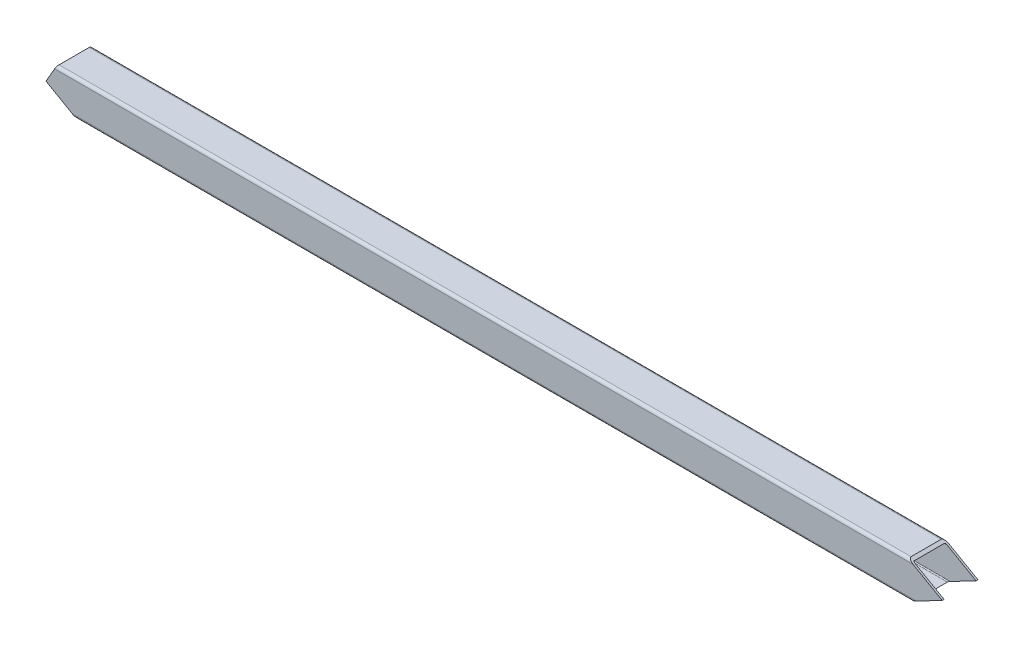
ISO-10303-21;
HEADER;
FILE_DESCRIPTION(('STEP AP214'),'2;1');
FILE_NAME('part.step','',(''),(''),'','','');
FILE_SCHEMA(('AUTOMOTIVE_DESIGN { 1 0 10303 214 1 1 1 1 }'));
ENDSEC;
DATA;
#1=APPLICATION_CONTEXT('core data for automotive mechanical design processes');
#2=APPLICATION_PROTOCOL_DEFINITION('international standard','automotive_design',2000,#1);
#3=PRODUCT_CONTEXT('',#1,'mechanical');
#4=PRODUCT('Part','Part','',(#3));
#5=PRODUCT_RELATED_PRODUCT_CATEGORY('part','',(#4));
#6=PRODUCT_DEFINITION_FORMATION('','',#4);
#7=PRODUCT_DEFINITION_CONTEXT('part definition',#1,'design');
#8=PRODUCT_DEFINITION('design','',#6,#7);
#9=PRODUCT_DEFINITION_SHAPE('','',#8);
#10=(LENGTH_UNIT() NAMED_UNIT(*) SI_UNIT(.MILLI.,.METRE.));
#11=(NAMED_UNIT(*) PLANE_ANGLE_UNIT() SI_UNIT($,.RADIAN.));
#12=(NAMED_UNIT(*) SI_UNIT($,.STERADIAN.) SOLID_ANGLE_UNIT());
#13=UNCERTAINTY_MEASURE_WITH_UNIT(LENGTH_MEASURE(1.E-05),#10,'distance_accuracy_value','');
#14=(GEOMETRIC_REPRESENTATION_CONTEXT(3) GLOBAL_UNCERTAINTY_ASSIGNED_CONTEXT((#13)) GLOBAL_UNIT_ASSIGNED_CONTEXT((#10,
#11,#12)) REPRESENTATION_CONTEXT('',''));
#15=CARTESIAN_POINT('',(0.,0.,0.));
#16=DIRECTION('',(0.,0.,1.));
#17=DIRECTION('',(1.,0.,0.));
#18=AXIS2_PLACEMENT_3D('',#15,#16,#17);
#19=CARTESIAN_POINT('',(1016.,2.54,29.21));
#20=DIRECTION('',(-1.,0.,0.));
#21=DIRECTION('',(0.,0.,1.));
#22=AXIS2_PLACEMENT_3D('',#19,#20,#21);
#23=CYLINDRICAL_SURFACE('',#22,2.54);
#24=DIRECTION('',(-1.,0.,0.));
#25=VECTOR('',#24,1.);
#26=CARTESIAN_POINT('',(1016.,2.54000000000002,31.75));
#27=LINE('',#26,#25);
#28=CARTESIAN_POINT('',(772.2933560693,2.54000000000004,31.75));
#29=VERTEX_POINT('',#28);
#30=CARTESIAN_POINT('',(23.305843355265,2.53999999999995,31.75));
#31=VERTEX_POINT('',#30);
#32=EDGE_CURVE('E307',#29,#31,#27,.T.);
#33=ORIENTED_EDGE('',*,*,#32,.T.);
#34=CARTESIAN_POINT('',(23.3058433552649,2.54,29.21));
#35=DIRECTION('',(0.496626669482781,0.867964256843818,0.));
#36=DIRECTION('',(-0.867964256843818,0.496626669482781,0.));
#37=AXIS2_PLACEMENT_3D('',#34,#35,#36);
#38=ELLIPSE('',#37,5.11450583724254,2.54);
#39=CARTESIAN_POINT('',(27.7450516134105,0.,29.21));
#40=VERTEX_POINT('',#39);
#41=EDGE_CURVE('E179',#31,#40,#38,.T.);
#42=ORIENTED_EDGE('',*,*,#41,.T.);
#43=DIRECTION('',(-1.,0.,0.));
#44=VECTOR('',#43,1.);
#45=CARTESIAN_POINT('',(1016.,0.,29.21));
#46=LINE('',#45,#44);
#47=CARTESIAN_POINT('',(767.420488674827,0.,29.21));
#48=VERTEX_POINT('',#47);
#49=EDGE_CURVE('E325',#48,#40,#46,.T.);
#50=ORIENTED_EDGE('',*,*,#49,.F.);
#51=CARTESIAN_POINT('',(772.2933560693,2.54,29.21));
#52=DIRECTION('',(0.462227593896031,-0.886761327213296,0.));
#53=DIRECTION('',(-0.886761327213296,-0.462227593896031,0.));
#54=AXIS2_PLACEMENT_3D('',#51,#52,#53);
#55=ELLIPSE('',#54,5.49512844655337,2.54);
#56=EDGE_CURVE('E261',#29,#48,#55,.T.);
#57=ORIENTED_EDGE('',*,*,#56,.F.);
#58=EDGE_LOOP('',(#33,#42,#50,#57));
#59=FACE_BOUND('',#58,.T.);
#60=ADVANCED_FACE('F39',(#59),#23,.T.);
#61=CARTESIAN_POINT('',(1016.,0.,29.21));
#62=DIRECTION('',(0.,1.,0.));
#63=DIRECTION('',(0.,0.,1.));
#64=AXIS2_PLACEMENT_3D('',#61,#62,#63);
#65=PLANE('',#64);
#66=ORIENTED_EDGE('',*,*,#49,.T.);
#67=DIRECTION('',(0.,0.,-1.));
#68=VECTOR('',#67,1.);
#69=CARTESIAN_POINT('',(27.7450516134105,0.,29.21));
#70=LINE('',#69,#68);
#71=CARTESIAN_POINT('',(27.7450516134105,0.,2.54000000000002));
#72=VERTEX_POINT('',#71);
#73=EDGE_CURVE('E230',#40,#72,#70,.T.);
#74=ORIENTED_EDGE('',*,*,#73,.T.);
#75=DIRECTION('',(-1.,0.,0.));
#76=VECTOR('',#75,1.);
#77=CARTESIAN_POINT('',(1016.,0.,2.54000000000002));
#78=LINE('',#77,#76);
#79=CARTESIAN_POINT('',(767.420488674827,0.,2.54000000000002));
#80=VERTEX_POINT('',#79);
#81=EDGE_CURVE('E322',#80,#72,#78,.T.);
#82=ORIENTED_EDGE('',*,*,#81,.F.);
#83=DIRECTION('',(0.,0.,-1.));
#84=VECTOR('',#83,1.);
#85=CARTESIAN_POINT('',(767.420488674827,0.,29.21));
#86=LINE('',#85,#84);
#87=EDGE_CURVE('E259',#48,#80,#86,.T.);
#88=ORIENTED_EDGE('',*,*,#87,.F.);
#89=EDGE_LOOP('',(#66,#74,#82,#88));
#90=FACE_BOUND('',#89,.T.);
#91=ADVANCED_FACE('F381',(#90),#65,.F.);
#92=CARTESIAN_POINT('',(1016.,2.54,2.54));
#93=DIRECTION('',(-1.,0.,0.));
#94=DIRECTION('',(0.,0.,1.));
#95=AXIS2_PLACEMENT_3D('',#92,#93,#94);
#96=CYLINDRICAL_SURFACE('',#95,2.54);
#97=ORIENTED_EDGE('',*,*,#81,.T.);
#98=CARTESIAN_POINT('',(23.3058433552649,2.54,2.54));
#99=DIRECTION('',(0.496626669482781,0.867964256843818,0.));
#100=DIRECTION('',(-0.867964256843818,0.496626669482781,0.));
#101=AXIS2_PLACEMENT_3D('',#98,#99,#100);
#102=ELLIPSE('',#101,5.11450583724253,2.54);
#103=CARTESIAN_POINT('',(23.305843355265,2.53999999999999,0.));
#104=VERTEX_POINT('',#103);
#105=EDGE_CURVE('E227',#72,#104,#102,.T.);
#106=ORIENTED_EDGE('',*,*,#105,.T.);
#107=DIRECTION('',(-1.,0.,0.));
#108=VECTOR('',#107,1.);
#109=CARTESIAN_POINT('',(1016.,2.54000000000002,0.));
#110=LINE('',#109,#108);
#111=CARTESIAN_POINT('',(772.2933560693,2.54,0.));
#112=VERTEX_POINT('',#111);
#113=EDGE_CURVE('E319',#112,#104,#110,.T.);
#114=ORIENTED_EDGE('',*,*,#113,.F.);
#115=CARTESIAN_POINT('',(772.2933560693,2.54,2.54));
#116=DIRECTION('',(0.462227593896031,-0.886761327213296,0.));
#117=DIRECTION('',(-0.886761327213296,-0.462227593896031,0.));
#118=AXIS2_PLACEMENT_3D('',#115,#116,#117);
#119=ELLIPSE('',#118,5.49512844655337,2.54);
#120=EDGE_CURVE('E257',#80,#112,#119,.T.);
#121=ORIENTED_EDGE('',*,*,#120,.F.);
#122=EDGE_LOOP('',(#97,#106,#114,#121));
#123=FACE_BOUND('',#122,.T.);
#124=ADVANCED_FACE('F387',(#123),#96,.T.);
#125=CARTESIAN_POINT('',(1016.,2.54000000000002,0.));
#126=DIRECTION('',(0.,0.,1.));
#127=DIRECTION('',(1.,0.,0.));
#128=AXIS2_PLACEMENT_3D('',#125,#126,#127);
#129=PLANE('',#128);
#130=DIRECTION('',(-0.867964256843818,0.496626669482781,0.));
#131=VECTOR('',#130,1.);
#132=CARTESIAN_POINT('',(771.163850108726,-425.364983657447,0.));
#133=LINE('',#132,#131);
#134=CARTESIAN_POINT('',(0.,15.8750000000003,0.));
#135=VERTEX_POINT('',#134);
#136=EDGE_CURVE('E224',#104,#135,#133,.T.);
#137=ORIENTED_EDGE('',*,*,#136,.T.);
#138=DIRECTION('',(0.497053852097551,0.86771969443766,0.));
#139=VECTOR('',#138,1.);
#140=CARTESIAN_POINT('',(245.264101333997,444.038850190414,0.));
#141=LINE('',#140,#139);
#142=CARTESIAN_POINT('',(7.63865699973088,29.21,0.));
#143=VERTEX_POINT('',#142);
#144=EDGE_CURVE('E211',#135,#143,#141,.T.);
#145=ORIENTED_EDGE('',*,*,#144,.T.);
#146=DIRECTION('',(-1.,0.,0.));
#147=VECTOR('',#146,1.);
#148=CARTESIAN_POINT('',(1016.,29.21,0.));
#149=LINE('',#148,#147);
#150=CARTESIAN_POINT('',(769.442558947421,29.21,0.));
#151=VERTEX_POINT('',#150);
#152=EDGE_CURVE('E316',#151,#143,#149,.T.);
#153=ORIENTED_EDGE('',*,*,#152,.F.);
#154=DIRECTION('',(0.867964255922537,-0.496626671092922,0.));
#155=VECTOR('',#154,1.);
#156=CARTESIAN_POINT('',(966.685768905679,-83.6474570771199,0.));
#157=LINE('',#156,#155);
#158=CARTESIAN_POINT('',(795.192763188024,14.476399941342,0.));
#159=VERTEX_POINT('',#158);
#160=EDGE_CURVE('E280',#151,#159,#157,.T.);
#161=ORIENTED_EDGE('',*,*,#160,.T.);
#162=DIRECTION('',(0.886761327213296,0.462227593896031,0.));
#163=VECTOR('',#162,1.);
#164=CARTESIAN_POINT('',(963.931015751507,102.431832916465,0.));
#165=LINE('',#164,#163);
#166=EDGE_CURVE('E255',#112,#159,#165,.T.);
#167=ORIENTED_EDGE('',*,*,#166,.F.);
#168=ORIENTED_EDGE('',*,*,#113,.T.);
#169=EDGE_LOOP('',(#137,#145,#153,#161,#167,#168));
#170=FACE_BOUND('',#169,.T.);
#171=ADVANCED_FACE('F364',(#170),#129,.F.);
#172=CARTESIAN_POINT('',(1016.,29.21,31.75));
#173=DIRECTION('',(0.,0.,-1.));
#174=DIRECTION('',(0.,1.,0.));
#175=AXIS2_PLACEMENT_3D('',#172,#173,#174);
#176=PLANE('',#175);
#177=DIRECTION('',(-1.,0.,0.));
#178=VECTOR('',#177,1.);
#179=CARTESIAN_POINT('',(1016.,29.21,31.75));
#180=LINE('',#179,#178);
#181=CARTESIAN_POINT('',(769.442558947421,29.21,31.75));
#182=VERTEX_POINT('',#181);
#183=CARTESIAN_POINT('',(7.63865699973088,29.21,31.75));
#184=VERTEX_POINT('',#183);
#185=EDGE_CURVE('E194',#182,#184,#180,.T.);
#186=ORIENTED_EDGE('',*,*,#185,.T.);
#187=DIRECTION('',(0.49705385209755,0.86771969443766,0.));
#188=VECTOR('',#187,1.);
#189=CARTESIAN_POINT('',(0.,15.8750000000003,31.75));
#190=LINE('',#189,#188);
#191=CARTESIAN_POINT('',(0.,15.8750000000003,31.75));
#192=VERTEX_POINT('',#191);
#193=EDGE_CURVE('E53',#192,#184,#190,.T.);
#194=ORIENTED_EDGE('',*,*,#193,.F.);
#195=DIRECTION('',(-0.867964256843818,0.496626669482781,0.));
#196=VECTOR('',#195,1.);
#197=CARTESIAN_POINT('',(0.,15.8750000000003,31.75));
#198=LINE('',#197,#196);
#199=EDGE_CURVE('E174',#31,#192,#198,.T.);
#200=ORIENTED_EDGE('',*,*,#199,.F.);
#201=ORIENTED_EDGE('',*,*,#32,.F.);
#202=DIRECTION('',(0.886761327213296,0.462227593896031,0.));
#203=VECTOR('',#202,1.);
#204=CARTESIAN_POINT('',(729.94766813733,-19.5328451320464,31.75));
#205=LINE('',#204,#203);
#206=CARTESIAN_POINT('',(795.192763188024,14.476399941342,31.75));
#207=VERTEX_POINT('',#206);
#208=EDGE_CURVE('E234',#29,#207,#205,.T.);
#209=ORIENTED_EDGE('',*,*,#208,.T.);
#210=DIRECTION('',(0.867964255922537,-0.496626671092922,0.));
#211=VECTOR('',#210,1.);
#212=CARTESIAN_POINT('',(745.815003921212,42.7290751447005,31.75));
#213=LINE('',#212,#211);
#214=EDGE_CURVE('E237',#182,#207,#213,.T.);
#215=ORIENTED_EDGE('',*,*,#214,.F.);
#216=EDGE_LOOP('',(#186,#194,#200,#201,#209,#215));
#217=FACE_BOUND('',#216,.T.);
#218=ADVANCED_FACE('F191',(#217),#176,.F.);
#219=CARTESIAN_POINT('',(1016.,2.54,2.54));
#220=DIRECTION('',(-1.,0.,0.));
#221=DIRECTION('',(0.,0.,1.));
#222=AXIS2_PLACEMENT_3D('',#219,#220,#221);
#223=CYLINDRICAL_SURFACE('',#222,0.889);
#224=CARTESIAN_POINT('',(23.3058433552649,2.54,2.54));
#225=DIRECTION('',(0.496626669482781,0.867964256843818,0.));
#226=DIRECTION('',(-0.867964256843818,0.496626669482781,0.));
#227=AXIS2_PLACEMENT_3D('',#224,#225,#226);
#228=ELLIPSE('',#227,1.79007704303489,0.889);
#229=CARTESIAN_POINT('',(24.8595662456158,1.651,2.54000000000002));
#230=VERTEX_POINT('',#229);
#231=CARTESIAN_POINT('',(23.3058433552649,2.54000000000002,1.651));
#232=VERTEX_POINT('',#231);
#233=EDGE_CURVE('E220',#230,#232,#228,.T.);
#234=ORIENTED_EDGE('',*,*,#233,.F.);
#235=DIRECTION('',(-1.,0.,0.));
#236=VECTOR('',#235,1.);
#237=CARTESIAN_POINT('',(1016.,1.651,2.54000000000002));
#238=LINE('',#237,#236);
#239=CARTESIAN_POINT('',(770.587852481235,1.651,2.54000000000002));
#240=VERTEX_POINT('',#239);
#241=EDGE_CURVE('E283',#240,#230,#238,.T.);
#242=ORIENTED_EDGE('',*,*,#241,.F.);
#243=CARTESIAN_POINT('',(772.2933560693,2.54,2.54));
#244=DIRECTION('',(0.462227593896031,-0.886761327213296,0.));
#245=DIRECTION('',(-0.886761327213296,-0.462227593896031,0.));
#246=AXIS2_PLACEMENT_3D('',#243,#244,#245);
#247=ELLIPSE('',#246,1.92329495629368,0.889);
#248=CARTESIAN_POINT('',(772.2933560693,2.54000000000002,1.651));
#249=VERTEX_POINT('',#248);
#250=EDGE_CURVE('E249',#240,#249,#247,.T.);
#251=ORIENTED_EDGE('',*,*,#250,.T.);
#252=DIRECTION('',(-1.,0.,0.));
#253=VECTOR('',#252,1.);
#254=CARTESIAN_POINT('',(1016.,2.54000000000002,1.651));
#255=LINE('',#254,#253);
#256=EDGE_CURVE('E304',#249,#232,#255,.T.);
#257=ORIENTED_EDGE('',*,*,#256,.T.);
#258=EDGE_LOOP('',(#234,#242,#251,#257));
#259=FACE_BOUND('',#258,.T.);
#260=ADVANCED_FACE('F354',(#259),#223,.F.);
#261=CARTESIAN_POINT('',(1016.,2.54000000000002,1.651));
#262=DIRECTION('',(0.,0.,1.));
#263=DIRECTION('',(1.,0.,0.));
#264=AXIS2_PLACEMENT_3D('',#261,#262,#263);
#265=PLANE('',#264);
#266=DIRECTION('',(0.497053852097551,0.86771969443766,0.));
#267=VECTOR('',#266,1.);
#268=CARTESIAN_POINT('',(245.264101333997,444.038850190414,1.651));
#269=LINE('',#268,#267);
#270=CARTESIAN_POINT('',(0.,15.8750000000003,1.651));
#271=VERTEX_POINT('',#270);
#272=CARTESIAN_POINT('',(7.63865699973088,29.21,1.651));
#273=VERTEX_POINT('',#272);
#274=EDGE_CURVE('E204',#271,#273,#269,.T.);
#275=ORIENTED_EDGE('',*,*,#274,.F.);
#276=DIRECTION('',(-0.867964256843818,0.496626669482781,0.));
#277=VECTOR('',#276,1.);
#278=CARTESIAN_POINT('',(771.163850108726,-425.364983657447,1.651));
#279=LINE('',#278,#277);
#280=EDGE_CURVE('E222',#232,#271,#279,.T.);
#281=ORIENTED_EDGE('',*,*,#280,.F.);
#282=ORIENTED_EDGE('',*,*,#256,.F.);
#283=DIRECTION('',(0.886761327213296,0.462227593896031,0.));
#284=VECTOR('',#283,1.);
#285=CARTESIAN_POINT('',(963.931015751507,102.431832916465,1.651));
#286=LINE('',#285,#284);
#287=CARTESIAN_POINT('',(795.192763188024,14.476399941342,1.651));
#288=VERTEX_POINT('',#287);
#289=EDGE_CURVE('E252',#249,#288,#286,.T.);
#290=ORIENTED_EDGE('',*,*,#289,.T.);
#291=DIRECTION('',(0.867964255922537,-0.496626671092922,0.));
#292=VECTOR('',#291,1.);
#293=CARTESIAN_POINT('',(966.685768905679,-83.6474570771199,1.651));
#294=LINE('',#293,#292);
#295=CARTESIAN_POINT('',(769.442558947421,29.21,1.651));
#296=VERTEX_POINT('',#295);
#297=EDGE_CURVE('E269',#296,#288,#294,.T.);
#298=ORIENTED_EDGE('',*,*,#297,.F.);
#299=DIRECTION('',(-1.,0.,0.));
#300=VECTOR('',#299,1.);
#301=CARTESIAN_POINT('',(1016.,29.21,1.651));
#302=LINE('',#301,#300);
#303=EDGE_CURVE('E301',#296,#273,#302,.T.);
#304=ORIENTED_EDGE('',*,*,#303,.T.);
#305=EDGE_LOOP('',(#275,#281,#282,#290,#298,#304));
#306=FACE_BOUND('',#305,.T.);
#307=ADVANCED_FACE('F358',(#306),#265,.T.);
#308=CARTESIAN_POINT('',(1016.,29.21,30.099));
#309=DIRECTION('',(0.,0.,-1.));
#310=DIRECTION('',(-1.,0.,0.));
#311=AXIS2_PLACEMENT_3D('',#308,#309,#310);
#312=PLANE('',#311);
#313=DIRECTION('',(-0.497053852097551,-0.86771969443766,0.));
#314=VECTOR('',#313,1.);
#315=CARTESIAN_POINT('',(256.76696345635,464.11969246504,30.099));
#316=LINE('',#315,#314);
#317=CARTESIAN_POINT('',(7.63865699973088,29.21,30.099));
#318=VERTEX_POINT('',#317);
#319=CARTESIAN_POINT('',(0.,15.8750000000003,30.099));
#320=VERTEX_POINT('',#319);
#321=EDGE_CURVE('E187',#318,#320,#316,.T.);
#322=ORIENTED_EDGE('',*,*,#321,.F.);
#323=DIRECTION('',(-1.,0.,0.));
#324=VECTOR('',#323,1.);
#325=CARTESIAN_POINT('',(1016.,29.21,30.099));
#326=LINE('',#325,#324);
#327=CARTESIAN_POINT('',(769.442558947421,29.21,30.099));
#328=VERTEX_POINT('',#327);
#329=EDGE_CURVE('E292',#328,#318,#326,.T.);
#330=ORIENTED_EDGE('',*,*,#329,.F.);
#331=DIRECTION('',(-0.867964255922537,0.496626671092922,0.));
#332=VECTOR('',#331,1.);
#333=CARTESIAN_POINT('',(955.18955341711,-77.0696202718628,30.099));
#334=LINE('',#333,#332);
#335=CARTESIAN_POINT('',(795.192763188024,14.476399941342,30.099));
#336=VERTEX_POINT('',#335);
#337=EDGE_CURVE('E46',#336,#328,#334,.T.);
#338=ORIENTED_EDGE('',*,*,#337,.F.);
#339=DIRECTION('',(-0.886761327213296,-0.462227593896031,0.));
#340=VECTOR('',#339,1.);
#341=CARTESIAN_POINT('',(974.862663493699,108.129994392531,30.099));
#342=LINE('',#341,#340);
#343=CARTESIAN_POINT('',(772.2933560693,2.54000000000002,30.099));
#344=VERTEX_POINT('',#343);
#345=EDGE_CURVE('E246',#336,#344,#342,.T.);
#346=ORIENTED_EDGE('',*,*,#345,.T.);
#347=DIRECTION('',(-1.,0.,0.));
#348=VECTOR('',#347,1.);
#349=CARTESIAN_POINT('',(1016.,2.54000000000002,30.099));
#350=LINE('',#349,#348);
#351=CARTESIAN_POINT('',(23.3058433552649,2.54000000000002,30.099));
#352=VERTEX_POINT('',#351);
#353=EDGE_CURVE('E289',#344,#352,#350,.T.);
#354=ORIENTED_EDGE('',*,*,#353,.T.);
#355=DIRECTION('',(0.867964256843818,-0.496626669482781,0.));
#356=VECTOR('',#355,1.);
#357=CARTESIAN_POINT('',(759.667634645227,-418.787146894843,30.099));
#358=LINE('',#357,#356);
#359=EDGE_CURVE('E218',#320,#352,#358,.T.);
#360=ORIENTED_EDGE('',*,*,#359,.F.);
#361=EDGE_LOOP('',(#322,#330,#338,#346,#354,#360));
#362=FACE_BOUND('',#361,.T.);
#363=ADVANCED_FACE('F341',(#362),#312,.T.);
#364=CARTESIAN_POINT('',(1016.,2.54,29.21));
#365=DIRECTION('',(-1.,0.,0.));
#366=DIRECTION('',(0.,0.,1.));
#367=AXIS2_PLACEMENT_3D('',#364,#365,#366);
#368=CYLINDRICAL_SURFACE('',#367,0.889000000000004);
#369=CARTESIAN_POINT('',(23.3058433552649,2.54,29.21));
#370=DIRECTION('',(0.496626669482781,0.867964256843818,0.));
#371=DIRECTION('',(-0.867964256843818,0.496626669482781,0.));
#372=AXIS2_PLACEMENT_3D('',#369,#370,#371);
#373=ELLIPSE('',#372,1.7900770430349,0.889000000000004);
#374=CARTESIAN_POINT('',(24.8595662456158,1.651,29.21));
#375=VERTEX_POINT('',#374);
#376=EDGE_CURVE('E216',#352,#375,#373,.T.);
#377=ORIENTED_EDGE('',*,*,#376,.F.);
#378=ORIENTED_EDGE('',*,*,#353,.F.);
#379=CARTESIAN_POINT('',(772.2933560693,2.54,29.21));
#380=DIRECTION('',(0.462227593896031,-0.886761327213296,0.));
#381=DIRECTION('',(-0.886761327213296,-0.462227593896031,0.));
#382=AXIS2_PLACEMENT_3D('',#379,#380,#381);
#383=ELLIPSE('',#382,1.92329495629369,0.889000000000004);
#384=CARTESIAN_POINT('',(770.587852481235,1.651,29.21));
#385=VERTEX_POINT('',#384);
#386=EDGE_CURVE('E243',#344,#385,#383,.T.);
#387=ORIENTED_EDGE('',*,*,#386,.T.);
#388=DIRECTION('',(-1.,0.,0.));
#389=VECTOR('',#388,1.);
#390=CARTESIAN_POINT('',(1016.,1.651,29.21));
#391=LINE('',#390,#389);
#392=EDGE_CURVE('E286',#385,#375,#391,.T.);
#393=ORIENTED_EDGE('',*,*,#392,.T.);
#394=EDGE_LOOP('',(#377,#378,#387,#393));
#395=FACE_BOUND('',#394,.T.);
#396=ADVANCED_FACE('F346',(#395),#368,.F.);
#397=CARTESIAN_POINT('',(1016.,1.651,29.21));
#398=DIRECTION('',(0.,1.,0.));
#399=DIRECTION('',(0.,0.,1.));
#400=AXIS2_PLACEMENT_3D('',#397,#398,#399);
#401=PLANE('',#400);
#402=DIRECTION('',(0.,0.,-1.));
#403=VECTOR('',#402,1.);
#404=CARTESIAN_POINT('',(24.8595662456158,1.651,29.21));
#405=LINE('',#404,#403);
#406=EDGE_CURVE('E214',#375,#230,#405,.T.);
#407=ORIENTED_EDGE('',*,*,#406,.F.);
#408=ORIENTED_EDGE('',*,*,#392,.F.);
#409=DIRECTION('',(0.,0.,-1.));
#410=VECTOR('',#409,1.);
#411=CARTESIAN_POINT('',(770.587852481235,1.651,29.21));
#412=LINE('',#411,#410);
#413=EDGE_CURVE('E328',#385,#240,#412,.T.);
#414=ORIENTED_EDGE('',*,*,#413,.T.);
#415=ORIENTED_EDGE('',*,*,#241,.T.);
#416=EDGE_LOOP('',(#407,#408,#414,#415));
#417=FACE_BOUND('',#416,.T.);
#418=ADVANCED_FACE('F349',(#417),#401,.T.);
#419=CARTESIAN_POINT('',(1016.,29.21,2.54));
#420=DIRECTION('',(-1.,0.,0.));
#421=DIRECTION('',(0.,0.,1.));
#422=AXIS2_PLACEMENT_3D('',#419,#420,#421);
#423=CYLINDRICAL_SURFACE('',#422,2.54);
#424=ORIENTED_EDGE('',*,*,#152,.T.);
#425=CARTESIAN_POINT('',(7.63865699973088,29.21,2.54));
#426=DIRECTION('',(0.86771969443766,-0.497053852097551,0.));
#427=DIRECTION('',(-0.497053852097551,-0.86771969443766,0.));
#428=AXIS2_PLACEMENT_3D('',#425,#426,#427);
#429=ELLIPSE('',#428,2.92721257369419,2.54);
#430=CARTESIAN_POINT('',(9.09363928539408,31.75,2.54000000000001));
#431=VERTEX_POINT('',#430);
#432=EDGE_CURVE('E208',#143,#431,#429,.T.);
#433=ORIENTED_EDGE('',*,*,#432,.T.);
#434=DIRECTION('',(-1.,0.,0.));
#435=VECTOR('',#434,1.);
#436=CARTESIAN_POINT('',(1016.,31.75,2.54000000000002));
#437=LINE('',#436,#435);
#438=CARTESIAN_POINT('',(765.00335070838,31.75,2.54000000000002));
#439=VERTEX_POINT('',#438);
#440=EDGE_CURVE('E313',#439,#431,#437,.T.);
#441=ORIENTED_EDGE('',*,*,#440,.F.);
#442=CARTESIAN_POINT('',(769.442558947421,29.21,2.54));
#443=DIRECTION('',(-0.496626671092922,-0.867964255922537,0.));
#444=DIRECTION('',(-0.867964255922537,0.496626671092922,0.));
#445=AXIS2_PLACEMENT_3D('',#442,#443,#444);
#446=ELLIPSE('',#445,5.11450582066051,2.54);
#447=EDGE_CURVE('E277',#439,#151,#446,.T.);
#448=ORIENTED_EDGE('',*,*,#447,.T.);
#449=EDGE_LOOP('',(#424,#433,#441,#448));
#450=FACE_BOUND('',#449,.T.);
#451=ADVANCED_FACE('F366',(#450),#423,.T.);
#452=CARTESIAN_POINT('',(1016.,31.75,2.54000000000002));
#453=DIRECTION('',(0.,-1.,0.));
#454=DIRECTION('',(0.,0.,-1.));
#455=AXIS2_PLACEMENT_3D('',#452,#453,#454);
#456=PLANE('',#455);
#457=ORIENTED_EDGE('',*,*,#440,.T.);
#458=DIRECTION('',(0.,0.,1.));
#459=VECTOR('',#458,1.);
#460=CARTESIAN_POINT('',(9.09363928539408,31.75,-6.35000000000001));
#461=LINE('',#460,#459);
#462=CARTESIAN_POINT('',(9.09363928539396,31.75,29.21));
#463=VERTEX_POINT('',#462);
#464=EDGE_CURVE('E197',#431,#463,#461,.T.);
#465=ORIENTED_EDGE('',*,*,#464,.T.);
#466=DIRECTION('',(-1.,0.,0.));
#467=VECTOR('',#466,1.);
#468=CARTESIAN_POINT('',(1016.,31.75,29.21));
#469=LINE('',#468,#467);
#470=CARTESIAN_POINT('',(765.00335070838,31.75,29.21));
#471=VERTEX_POINT('',#470);
#472=EDGE_CURVE('E310',#471,#463,#469,.T.);
#473=ORIENTED_EDGE('',*,*,#472,.F.);
#474=DIRECTION('',(0.,0.,-1.));
#475=VECTOR('',#474,1.);
#476=CARTESIAN_POINT('',(765.00335070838,31.75,2.54000000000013));
#477=LINE('',#476,#475);
#478=EDGE_CURVE('E274',#471,#439,#477,.T.);
#479=ORIENTED_EDGE('',*,*,#478,.T.);
#480=EDGE_LOOP('',(#457,#465,#473,#479));
#481=FACE_BOUND('',#480,.T.);
#482=ADVANCED_FACE('F371',(#481),#456,.F.);
#483=CARTESIAN_POINT('',(1016.,29.21,29.21));
#484=DIRECTION('',(-1.,0.,0.));
#485=DIRECTION('',(0.,0.,1.));
#486=AXIS2_PLACEMENT_3D('',#483,#484,#485);
#487=CYLINDRICAL_SURFACE('',#486,2.54);
#488=ORIENTED_EDGE('',*,*,#472,.T.);
#489=CARTESIAN_POINT('',(7.63865699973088,29.21,29.21));
#490=DIRECTION('',(0.86771969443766,-0.497053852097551,0.));
#491=DIRECTION('',(-0.497053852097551,-0.86771969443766,0.));
#492=AXIS2_PLACEMENT_3D('',#489,#490,#491);
#493=ELLIPSE('',#492,2.92721257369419,2.54);
#494=EDGE_CURVE('E206',#463,#184,#493,.T.);
#495=ORIENTED_EDGE('',*,*,#494,.T.);
#496=ORIENTED_EDGE('',*,*,#185,.F.);
#497=CARTESIAN_POINT('',(769.442558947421,29.21,29.21));
#498=DIRECTION('',(-0.496626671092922,-0.867964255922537,0.));
#499=DIRECTION('',(-0.867964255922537,0.496626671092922,0.));
#500=AXIS2_PLACEMENT_3D('',#497,#498,#499);
#501=ELLIPSE('',#500,5.11450582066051,2.54);
#502=EDGE_CURVE('E271',#182,#471,#501,.T.);
#503=ORIENTED_EDGE('',*,*,#502,.T.);
#504=EDGE_LOOP('',(#488,#495,#496,#503));
#505=FACE_BOUND('',#504,.T.);
#506=ADVANCED_FACE('F373',(#505),#487,.T.);
#507=CARTESIAN_POINT('',(1016.,29.21,2.54));
#508=DIRECTION('',(-1.,0.,0.));
#509=DIRECTION('',(0.,0.,1.));
#510=AXIS2_PLACEMENT_3D('',#507,#508,#509);
#511=CYLINDRICAL_SURFACE('',#510,0.889);
#512=CARTESIAN_POINT('',(7.63865699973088,29.21,2.54));
#513=DIRECTION('',(0.86771969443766,-0.497053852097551,0.));
#514=DIRECTION('',(-0.497053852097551,-0.86771969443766,0.));
#515=AXIS2_PLACEMENT_3D('',#512,#513,#514);
#516=ELLIPSE('',#515,1.02452440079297,0.889);
#517=CARTESIAN_POINT('',(8.14790079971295,30.099,2.54000000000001));
#518=VERTEX_POINT('',#517);
#519=EDGE_CURVE('E201',#273,#518,#516,.T.);
#520=ORIENTED_EDGE('',*,*,#519,.F.);
#521=ORIENTED_EDGE('',*,*,#303,.F.);
#522=CARTESIAN_POINT('',(769.442558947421,29.21,2.54));
#523=DIRECTION('',(-0.496626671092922,-0.867964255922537,0.));
#524=DIRECTION('',(-0.867964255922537,0.496626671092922,0.));
#525=AXIS2_PLACEMENT_3D('',#522,#523,#524);
#526=ELLIPSE('',#525,1.79007703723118,0.889);
#527=CARTESIAN_POINT('',(767.888836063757,30.099,2.54000000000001));
#528=VERTEX_POINT('',#527);
#529=EDGE_CURVE('E267',#528,#296,#526,.T.);
#530=ORIENTED_EDGE('',*,*,#529,.F.);
#531=DIRECTION('',(-1.,0.,0.));
#532=VECTOR('',#531,1.);
#533=CARTESIAN_POINT('',(1016.,30.099,2.54000000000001));
#534=LINE('',#533,#532);
#535=EDGE_CURVE('E298',#528,#518,#534,.T.);
#536=ORIENTED_EDGE('',*,*,#535,.T.);
#537=EDGE_LOOP('',(#520,#521,#530,#536));
#538=FACE_BOUND('',#537,.T.);
#539=ADVANCED_FACE('F392',(#538),#511,.F.);
#540=CARTESIAN_POINT('',(1016.,30.099,2.54000000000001));
#541=DIRECTION('',(0.,-1.,0.));
#542=DIRECTION('',(0.,0.,-1.));
#543=AXIS2_PLACEMENT_3D('',#540,#541,#542);
#544=PLANE('',#543);
#545=DIRECTION('',(0.,0.,1.));
#546=VECTOR('',#545,1.);
#547=CARTESIAN_POINT('',(8.14790079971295,30.099,2.54000000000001));
#548=LINE('',#547,#546);
#549=CARTESIAN_POINT('',(8.14790079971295,30.099,29.21));
#550=VERTEX_POINT('',#549);
#551=EDGE_CURVE('E59',#518,#550,#548,.T.);
#552=ORIENTED_EDGE('',*,*,#551,.F.);
#553=ORIENTED_EDGE('',*,*,#535,.F.);
#554=DIRECTION('',(0.,0.,-1.));
#555=VECTOR('',#554,1.);
#556=CARTESIAN_POINT('',(767.888836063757,30.099,2.54000000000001));
#557=LINE('',#556,#555);
#558=CARTESIAN_POINT('',(767.888836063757,30.099,29.21));
#559=VERTEX_POINT('',#558);
#560=EDGE_CURVE('E265',#559,#528,#557,.T.);
#561=ORIENTED_EDGE('',*,*,#560,.F.);
#562=DIRECTION('',(-1.,0.,0.));
#563=VECTOR('',#562,1.);
#564=CARTESIAN_POINT('',(1016.,30.099,29.21));
#565=LINE('',#564,#563);
#566=EDGE_CURVE('E295',#559,#550,#565,.T.);
#567=ORIENTED_EDGE('',*,*,#566,.T.);
#568=EDGE_LOOP('',(#552,#553,#561,#567));
#569=FACE_BOUND('',#568,.T.);
#570=ADVANCED_FACE('F395',(#569),#544,.T.);
#571=CARTESIAN_POINT('',(1016.,29.21,29.21));
#572=DIRECTION('',(-1.,0.,0.));
#573=DIRECTION('',(0.,0.,1.));
#574=AXIS2_PLACEMENT_3D('',#571,#572,#573);
#575=CYLINDRICAL_SURFACE('',#574,0.889000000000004);
#576=CARTESIAN_POINT('',(7.63865699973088,29.21,29.21));
#577=DIRECTION('',(0.86771969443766,-0.497053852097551,0.));
#578=DIRECTION('',(-0.497053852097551,-0.86771969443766,0.));
#579=AXIS2_PLACEMENT_3D('',#576,#577,#578);
#580=ELLIPSE('',#579,1.02452440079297,0.889000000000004);
#581=EDGE_CURVE('E11',#550,#318,#580,.T.);
#582=ORIENTED_EDGE('',*,*,#581,.F.);
#583=ORIENTED_EDGE('',*,*,#566,.F.);
#584=CARTESIAN_POINT('',(769.442558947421,29.21,29.21));
#585=DIRECTION('',(-0.496626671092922,-0.867964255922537,0.));
#586=DIRECTION('',(-0.867964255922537,0.496626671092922,0.));
#587=AXIS2_PLACEMENT_3D('',#584,#585,#586);
#588=ELLIPSE('',#587,1.79007703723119,0.889000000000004);
#589=EDGE_CURVE('E263',#328,#559,#588,.T.);
#590=ORIENTED_EDGE('',*,*,#589,.F.);
#591=ORIENTED_EDGE('',*,*,#329,.T.);
#592=EDGE_LOOP('',(#582,#583,#590,#591));
#593=FACE_BOUND('',#592,.T.);
#594=ADVANCED_FACE('F340',(#593),#575,.F.);
#595=CARTESIAN_POINT('',(745.815003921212,42.7290751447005,-6.35000000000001));
#596=DIRECTION('',(-0.496626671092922,-0.867964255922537,0.));
#597=DIRECTION('',(0.867964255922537,-0.496626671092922,0.));
#598=AXIS2_PLACEMENT_3D('',#595,#596,#597);
#599=PLANE('',#598);
#600=ORIENTED_EDGE('',*,*,#447,.F.);
#601=ORIENTED_EDGE('',*,*,#478,.F.);
#602=ORIENTED_EDGE('',*,*,#502,.F.);
#603=ORIENTED_EDGE('',*,*,#214,.T.);
#604=DIRECTION('',(0.,0.,1.));
#605=VECTOR('',#604,1.);
#606=CARTESIAN_POINT('',(795.192763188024,14.476399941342,-6.35000000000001));
#607=LINE('',#606,#605);
#608=EDGE_CURVE('E239',#336,#207,#607,.T.);
#609=ORIENTED_EDGE('',*,*,#608,.F.);
#610=ORIENTED_EDGE('',*,*,#337,.T.);
#611=ORIENTED_EDGE('',*,*,#589,.T.);
#612=ORIENTED_EDGE('',*,*,#560,.T.);
#613=ORIENTED_EDGE('',*,*,#529,.T.);
#614=ORIENTED_EDGE('',*,*,#297,.T.);
#615=EDGE_CURVE('E242',#159,#288,#607,.T.);
#616=ORIENTED_EDGE('',*,*,#615,.F.);
#617=ORIENTED_EDGE('',*,*,#160,.F.);
#618=EDGE_LOOP('',(#600,#601,#602,#603,#609,#610,#611,#612,#613,#614,#616,#617));
#619=FACE_BOUND('',#618,.T.);
#620=ADVANCED_FACE('F334',(#619),#599,.F.);
#621=CARTESIAN_POINT('',(729.94766813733,-19.5328451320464,-6.35000000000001));
#622=DIRECTION('',(0.462227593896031,-0.886761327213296,0.));
#623=DIRECTION('',(0.886761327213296,0.462227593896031,0.));
#624=AXIS2_PLACEMENT_3D('',#621,#622,#623);
#625=PLANE('',#624);
#626=ORIENTED_EDGE('',*,*,#56,.T.);
#627=ORIENTED_EDGE('',*,*,#87,.T.);
#628=ORIENTED_EDGE('',*,*,#120,.T.);
#629=ORIENTED_EDGE('',*,*,#166,.T.);
#630=ORIENTED_EDGE('',*,*,#615,.T.);
#631=ORIENTED_EDGE('',*,*,#289,.F.);
#632=ORIENTED_EDGE('',*,*,#250,.F.);
#633=ORIENTED_EDGE('',*,*,#413,.F.);
#634=ORIENTED_EDGE('',*,*,#386,.F.);
#635=ORIENTED_EDGE('',*,*,#345,.F.);
#636=ORIENTED_EDGE('',*,*,#608,.T.);
#637=ORIENTED_EDGE('',*,*,#208,.F.);
#638=EDGE_LOOP('',(#626,#627,#628,#629,#630,#631,#632,#633,#634,#635,#636,#637));
#639=FACE_BOUND('',#638,.T.);
#640=ADVANCED_FACE('F376',(#639),#625,.T.);
#641=CARTESIAN_POINT('',(0.,15.8750000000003,-6.35000000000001));
#642=DIRECTION('',(0.496626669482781,0.867964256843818,0.));
#643=DIRECTION('',(-0.867964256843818,0.496626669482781,0.));
#644=AXIS2_PLACEMENT_3D('',#641,#642,#643);
#645=PLANE('',#644);
#646=ORIENTED_EDGE('',*,*,#199,.T.);
#647=DIRECTION('',(0.,0.,1.));
#648=VECTOR('',#647,1.);
#649=CARTESIAN_POINT('',(0.,15.8750000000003,-6.35000000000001));
#650=LINE('',#649,#648);
#651=EDGE_CURVE('E176',#320,#192,#650,.T.);
#652=ORIENTED_EDGE('',*,*,#651,.F.);
#653=ORIENTED_EDGE('',*,*,#359,.T.);
#654=ORIENTED_EDGE('',*,*,#376,.T.);
#655=ORIENTED_EDGE('',*,*,#406,.T.);
#656=ORIENTED_EDGE('',*,*,#233,.T.);
#657=ORIENTED_EDGE('',*,*,#280,.T.);
#658=EDGE_CURVE('E188',#135,#271,#650,.T.);
#659=ORIENTED_EDGE('',*,*,#658,.F.);
#660=ORIENTED_EDGE('',*,*,#136,.F.);
#661=ORIENTED_EDGE('',*,*,#105,.F.);
#662=ORIENTED_EDGE('',*,*,#73,.F.);
#663=ORIENTED_EDGE('',*,*,#41,.F.);
#664=EDGE_LOOP('',(#646,#652,#653,#654,#655,#656,#657,#659,#660,#661,#662,#663));
#665=FACE_BOUND('',#664,.T.);
#666=ADVANCED_FACE('F175',(#665),#645,.F.);
#667=CARTESIAN_POINT('',(0.,15.8750000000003,-6.35000000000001));
#668=DIRECTION('',(0.86771969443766,-0.497053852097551,0.));
#669=DIRECTION('',(0.497053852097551,0.86771969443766,0.));
#670=AXIS2_PLACEMENT_3D('',#667,#668,#669);
#671=PLANE('',#670);
#672=ORIENTED_EDGE('',*,*,#658,.T.);
#673=ORIENTED_EDGE('',*,*,#274,.T.);
#674=ORIENTED_EDGE('',*,*,#519,.T.);
#675=ORIENTED_EDGE('',*,*,#551,.T.);
#676=ORIENTED_EDGE('',*,*,#581,.T.);
#677=ORIENTED_EDGE('',*,*,#321,.T.);
#678=ORIENTED_EDGE('',*,*,#651,.T.);
#679=ORIENTED_EDGE('',*,*,#193,.T.);
#680=ORIENTED_EDGE('',*,*,#494,.F.);
#681=ORIENTED_EDGE('',*,*,#464,.F.);
#682=ORIENTED_EDGE('',*,*,#432,.F.);
#683=ORIENTED_EDGE('',*,*,#144,.F.);
#684=EDGE_LOOP('',(#672,#673,#674,#675,#676,#677,#678,#679,#680,#681,#682,#683));
#685=FACE_BOUND('',#684,.T.);
#686=ADVANCED_FACE('F185',(#685),#671,.F.);
#687=CLOSED_SHELL('',(#60,#91,#124,#171,#218,#260,#307,#363,#396,#418,#451,#482,#506,#539,#570,
#594,#620,#640,#666,#686));
#688=MANIFOLD_SOLID_BREP('B2',#687);
#689=ADVANCED_BREP_SHAPE_REPRESENTATION('',(#18,#688),#14);
#690=SHAPE_DEFINITION_REPRESENTATION(#9,#689);
ENDSEC;
END-ISO-10303-21;
